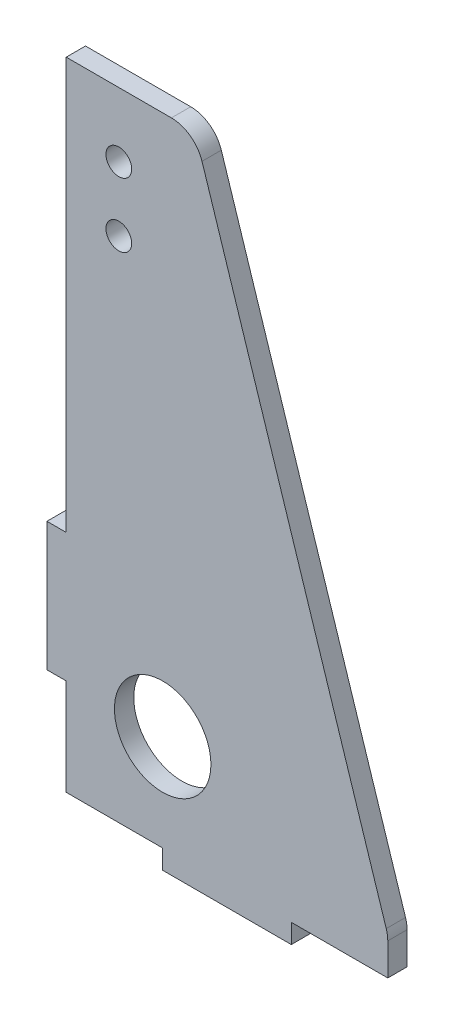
from build123d import *

# Parameters (mm, degrees)
ESQUISSE1_R        = 2
ESQUISSE1_R_2      = 7.5
BOSS_EXTRU_1_DEPTH = 3


with BuildPart() as part:
    # Esquisse1 → Boss.-Extru.1 (new body)
    with BuildSketch(Plane.XY):
        with BuildLine():
            Line((0, 0), (0, 15))
            Line((0, 15), (-3, 15))
            Line((-3, 15), (-3, 35))
            Line((-3, 35), (0, 35))
            Line((0, 35), (0, 99))
            Line((0, 99), (16.356612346, 99))
            ThreePointArc((16.356612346, 99), (19.301182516, 98.04097841), (21.11619014, 95.531802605))
            Line((21.11619014, 95.531802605), (49.759577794, 6.531802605))
            ThreePointArc((49.759577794, 6.531802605), (49.939528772, 5.775277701), (50, 5))
            Line((50, 5), (50, 0))
            Line((50, 0), (35, 0))
            Line((35, 0), (35, -3))
            Line((35, -3), (15, -3))
            Line((15, -3), (15, 0))
            Line((15, 0), (0, 0))
        make_face()
        with Locations((8.178306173, 89)):
            Circle(ESQUISSE1_R, mode=Mode.SUBTRACT)
        with Locations((8.178306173, 79)):
            Circle(ESQUISSE1_R, mode=Mode.SUBTRACT)
        with Locations((15, 15)):
            Circle(ESQUISSE1_R_2, mode=Mode.SUBTRACT)
    extrude(amount=BOSS_EXTRU_1_DEPTH)


solid = part.part
